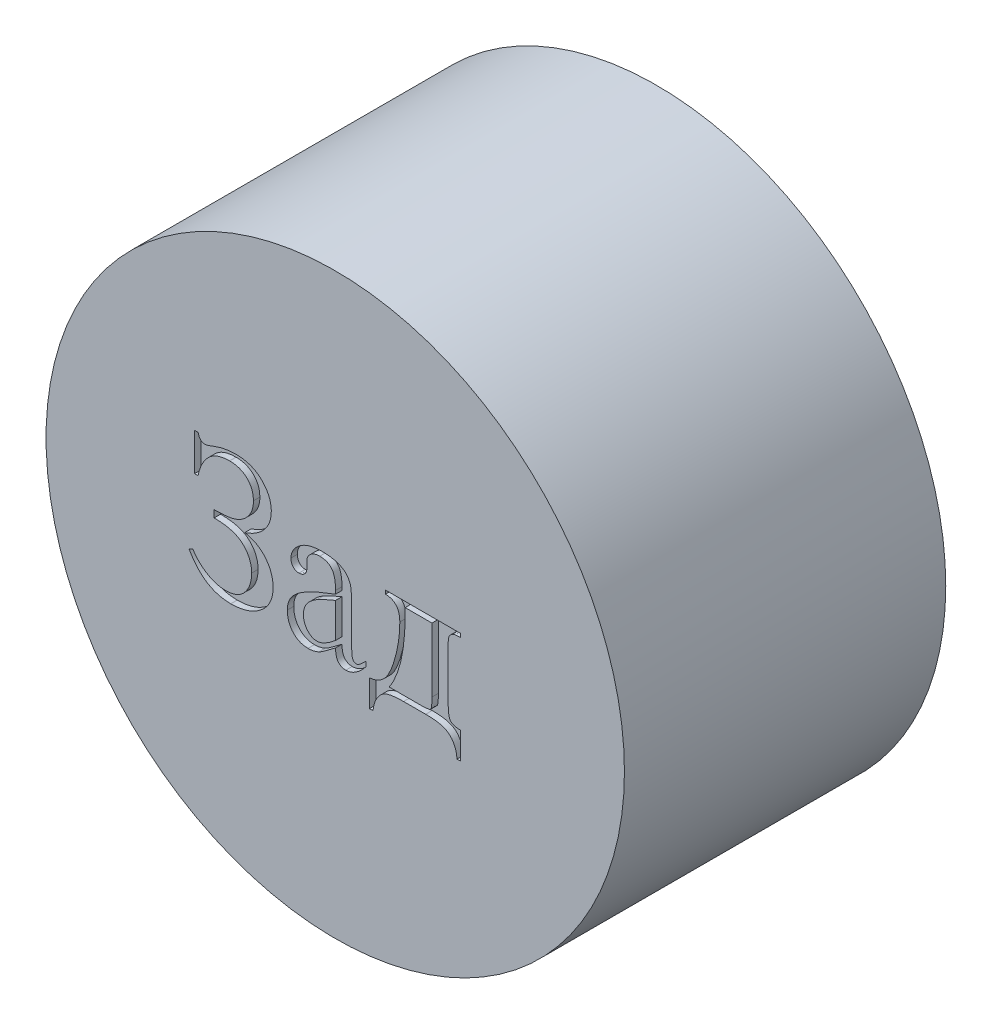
from build123d import *

# Parameters (mm, degrees)
SKETCH_1_R          = 45
EXTRUDE_1_DEPTH     = 50
CUT_EXTRUDE_1_DEPTH = 1
CUT_EXTRUDE_2_DEPTH = 1


with BuildPart() as part:
    # Sketch 1 → Extrude 1 (new body)
    with BuildSketch(Plane.XY):
        Circle(SKETCH_1_R)
    extrude(amount=EXTRUDE_1_DEPTH)

    # Sketch 2 → Cut-Extrude 1 (cut)
    # profile 1 of 3: a face of its own
    with BuildSketch(Plane.XY.offset(50)):
        with BuildLine():
            Line((-21.897257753, 6.710710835), (-21.897257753, 12.544044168))
            Line((-21.897257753, 12.544044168), (-21.341702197, 12.544044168))
            add(Edge.make_bspline(
                [(-21.341702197, 12.544044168), (-21.320378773, 12.461004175), (-21.27965936, 12.302430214), (-21.193013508, 12.084983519), (-21.089241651, 11.8958037), (-20.958088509, 11.745513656), (-20.812283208, 11.622016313), (-20.643784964, 11.539398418), (-20.456120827, 11.49049336), (-20.324940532, 11.484037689), (-20.256632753, 11.480676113)],
                knots=[0, 0, 0, 0, 1.235856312, 2.360002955, 3.36979489, 4.332079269, 5.222142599, 6.109017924, 7.015333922, 8, 8, 8, 8], degree=3))
            add(Edge.make_bspline(
                [(-20.256632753, 11.480676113), (-20.186863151, 11.487561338), (-20.015638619, 11.504458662), (-19.7177076, 11.593353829), (-19.329887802, 11.728724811), (-19.041047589, 11.839957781), (-18.880764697, 11.901683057)],
                knots=[0, 0, 0, 0, 0.581788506, 1.427791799, 2.57263306, 4, 4, 4, 4], degree=3))
            add(Edge.make_bspline(
                [(-18.880764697, 11.901683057), (-18.603318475, 12.001662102), (-18.048941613, 12.201434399), (-17.183361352, 12.394838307), (-16.300744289, 12.523320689), (-15.70414669, 12.537110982), (-15.404202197, 12.544044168)],
                knots=[0, 0, 0, 0, 0.994584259, 1.987320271, 2.988108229, 4, 4, 4, 4], degree=3))
            add(Edge.make_bspline(
                [(-15.404202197, 12.544044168), (-15.204354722, 12.540296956), (-14.812075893, 12.532941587), (-14.239440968, 12.462973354), (-13.697973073, 12.345044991), (-13.185572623, 12.184642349), (-12.703965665, 11.976759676), (-12.251919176, 11.721754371), (-11.828941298, 11.423444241), (-11.446157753, 11.07397497), (-11.09757339, 10.700973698), (-10.791606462, 10.309256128), (-10.532390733, 9.901097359), (-10.318507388, 9.477555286), (-10.158506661, 9.034978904), (-10.041041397, 8.580304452), (-9.962541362, 8.10954519), (-9.956083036, 7.788864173), (-9.952813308, 7.626509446)],
                knots=[0, 0, 0, 0, 1.170527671, 2.297618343, 3.373335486, 4.413498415, 5.438597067, 6.440585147, 7.449611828, 8.464000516, 9.471602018, 10.438074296, 11.371646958, 12.300396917, 13.21216504, 14.122947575, 15.049683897, 16, 16, 16, 16], degree=3))
            add(Edge.make_bspline(
                [(-9.952813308, 7.626509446), (-9.956219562, 7.480263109), (-9.962952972, 7.191166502), (-10.014295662, 6.764861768), (-10.10812196, 6.356535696), (-10.227605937, 5.961053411), (-10.390829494, 5.585287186), (-10.58055181, 5.220846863), (-10.812952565, 4.87790696), (-11.168612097, 4.44218142), (-11.684458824, 3.945787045), (-12.390430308, 3.427378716), (-13.19233738, 2.998274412), (-13.773526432, 2.789867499), (-14.071736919, 2.682933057)],
                knots=[0, 0, 0, 0, 0.761314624, 1.504950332, 2.230398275, 2.940313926, 3.652383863, 4.359938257, 5.076455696, 5.804596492, 7.285331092, 8.788782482, 10.35231112, 12, 12, 12, 12], degree=3))
            add(Edge.make_bspline(
                [(-14.071736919, 2.682933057), (-13.907777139, 2.648897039), (-13.584237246, 2.581734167), (-13.114483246, 2.445704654), (-12.674331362, 2.263057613), (-12.256344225, 2.057978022), (-11.867160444, 1.812644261), (-11.507065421, 1.531715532), (-11.164019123, 1.225554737), (-10.860676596, 0.876879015), (-10.582174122, 0.509389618), (-10.338701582, 0.123542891), (-10.133020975, -0.280431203), (-9.962114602, -0.699120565), (-9.83982018, -1.137239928), (-9.740576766, -1.587108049), (-9.684137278, -2.055201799), (-9.678090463, -2.373348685), (-9.67503553, -2.534080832)],
                knots=[0, 0, 0, 0, 1.079208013, 2.129588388, 3.146058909, 4.14692564, 5.127473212, 6.104823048, 7.088381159, 8.085810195, 9.077994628, 10.0585422, 11.021912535, 11.99681259, 12.96773536, 13.949877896, 14.964250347, 16, 16, 16, 16], degree=3))
            add(Edge.make_bspline(
                [(-9.67503553, -2.534080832), (-9.681010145, -2.731167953), (-9.69275534, -3.118611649), (-9.781410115, -3.686511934), (-9.926549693, -4.226705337), (-10.140672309, -4.735657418), (-10.403797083, -5.220385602), (-10.734220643, -5.674708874), (-11.121899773, -6.100452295), (-11.563717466, -6.493300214), (-12.049299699, -6.846584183), (-12.564409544, -7.161217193), (-13.112830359, -7.421044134), (-13.684871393, -7.640653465), (-14.289236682, -7.802965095), (-14.919583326, -7.927092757), (-15.580692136, -7.994592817), (-16.030512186, -8.005808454), (-16.259236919, -8.011511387)],
                knots=[0, 0, 0, 0, 0.98804211, 1.942342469, 2.875220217, 3.786056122, 4.705004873, 5.635311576, 6.595797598, 7.587562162, 8.594680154, 9.603808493, 10.609802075, 11.633920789, 12.672433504, 13.743903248, 14.85281875, 16, 16, 16, 16], degree=3))
            add(Edge.make_bspline(
                [(-16.259236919, -8.011511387), (-16.431520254, -8.008006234), (-16.770961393, -8.001100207), (-17.272483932, -7.951430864), (-17.758826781, -7.875331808), (-18.230681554, -7.762269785), (-18.685373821, -7.611354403), (-19.131870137, -7.442558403), (-19.555324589, -7.224195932), (-19.970854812, -6.988502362), (-20.367131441, -6.711958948), (-20.748428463, -6.402822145), (-21.118107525, -6.065023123), (-21.469583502, -5.693290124), (-21.811528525, -5.292647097), (-22.132812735, -4.855380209), (-22.444785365, -4.388651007), (-22.634073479, -4.060110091), (-22.730591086, -3.892587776)],
                knots=[0, 0, 0, 0, 1.022395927, 2.014374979, 2.988427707, 3.942287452, 4.889982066, 5.830766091, 6.771589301, 7.714174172, 8.664549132, 9.635455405, 10.626058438, 11.63425701, 12.669944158, 13.750164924, 14.852813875, 16, 16, 16, 16], degree=3))
            Line((-22.730591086, -3.892587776), (-22.17503553, -3.567066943))
            add(Edge.make_bspline(
                [(-22.17503553, -3.567066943), (-22.044213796, -3.771953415), (-21.779691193, -4.186235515), (-21.27991558, -4.746739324), (-20.702953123, -5.265388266), (-20.055041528, -5.733557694), (-19.351214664, -6.130620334), (-18.603400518, -6.412612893), (-17.828681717, -6.591347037), (-17.301866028, -6.612136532), (-17.036146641, -6.622622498)],
                knots=[0, 0, 0, 0, 0.933865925, 1.888284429, 2.877365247, 3.913803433, 4.957611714, 5.975718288, 6.978977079, 8, 8, 8, 8], degree=3))
            add(Edge.make_bspline(
                [(-17.036146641, -6.622622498), (-16.881203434, -6.6178367), (-16.578959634, -6.608501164), (-16.137674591, -6.553781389), (-15.723359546, -6.452870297), (-15.33559824, -6.314778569), (-14.974362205, -6.135828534), (-14.645163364, -5.911523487), (-14.33609501, -5.654552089), (-14.062608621, -5.354624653), (-13.814637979, -5.028866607), (-13.59898172, -4.682677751), (-13.412959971, -4.319247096), (-13.26851299, -3.93665128), (-13.147937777, -3.538650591), (-13.067475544, -3.122696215), (-13.018795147, -2.688599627), (-13.011894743, -2.393876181), (-13.008368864, -2.243282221)],
                knots=[0, 0, 0, 0, 1.111091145, 2.167377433, 3.181253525, 4.162283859, 5.113241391, 6.062613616, 7.012212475, 7.988405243, 8.965534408, 9.944093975, 10.908979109, 11.887538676, 12.87212695, 13.887222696, 14.920440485, 16, 16, 16, 16], degree=3))
            add(Edge.make_bspline(
                [(-13.008368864, -2.243282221), (-13.012923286, -2.088321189), (-13.021897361, -1.782984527), (-13.081518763, -1.332660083), (-13.192096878, -0.903181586), (-13.339203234, -0.49052529), (-13.532917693, -0.099410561), (-13.76293019, 0.278472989), (-14.042715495, 0.632302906), (-14.360739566, 0.969654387), (-14.72514403, 1.281837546), (-15.151458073, 1.547377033), (-15.633658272, 1.765459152), (-16.166684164, 1.955388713), (-16.757800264, 2.09516514), (-17.40384289, 2.19287495), (-18.104133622, 2.254088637), (-18.589834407, 2.262107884), (-18.841702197, 2.266266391)],
                knots=[0, 0, 0, 0, 0.890305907, 1.754267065, 2.602940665, 3.433762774, 4.266412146, 5.106042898, 5.970603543, 6.852489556, 7.766646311, 8.719034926, 9.726790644, 10.801939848, 11.965110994, 13.20998532, 14.553193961, 16, 16, 16, 16], degree=3))
            Line((-18.841702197, 2.266266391), (-18.841702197, 3.377377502))
            add(Edge.make_bspline(
                [(-18.841702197, 3.377377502), (-18.655063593, 3.379766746), (-18.293286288, 3.38439802), (-17.769181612, 3.399345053), (-17.279638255, 3.433365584), (-16.827087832, 3.487371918), (-16.407651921, 3.544781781), (-16.026745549, 3.623058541), (-15.68049198, 3.714653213), (-15.26786425, 3.850009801), (-14.798688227, 4.070175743), (-14.287255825, 4.401675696), (-13.838556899, 4.810861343), (-13.446052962, 5.28067103), (-13.122961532, 5.806224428), (-12.898418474, 6.384492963), (-12.751567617, 6.99852816), (-12.737673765, 7.423097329), (-12.730591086, 7.639530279)],
                knots=[0, 0, 0, 0, 1.058908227, 2.05257088, 2.974164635, 3.841572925, 4.637837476, 5.375061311, 6.045979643, 6.668893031, 7.836596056, 8.974822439, 10.113817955, 11.267679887, 12.438810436, 13.595616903, 14.774315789, 16, 16, 16, 16], degree=3))
            add(Edge.make_bspline(
                [(-12.730591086, 7.639530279), (-12.734621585, 7.765486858), (-12.742520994, 8.012350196), (-12.784020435, 8.374891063), (-12.863857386, 8.71883917), (-12.970890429, 9.047409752), (-13.115756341, 9.354173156), (-13.286606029, 9.646325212), (-13.491622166, 9.918824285), (-13.72447471, 10.174497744), (-13.985034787, 10.404262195), (-14.269341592, 10.60668199), (-14.577937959, 10.773998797), (-14.907134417, 10.915714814), (-15.259659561, 11.02254529), (-15.634080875, 11.10198304), (-16.031178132, 11.143310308), (-16.302558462, 11.151143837), (-16.441528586, 11.155155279)],
                knots=[0, 0, 0, 0, 1.050240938, 2.058375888, 3.03545227, 3.98879961, 4.932950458, 5.857412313, 6.805252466, 7.769746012, 8.735143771, 9.695406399, 10.672259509, 11.65556693, 12.67781137, 13.737357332, 14.841331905, 16, 16, 16, 16], degree=3))
            add(Edge.make_bspline(
                [(-16.441528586, 11.155155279), (-16.613903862, 11.152773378), (-16.95112159, 11.148113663), (-17.441520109, 11.084022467), (-17.903311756, 10.989737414), (-18.338168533, 10.860673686), (-18.742664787, 10.686489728), (-19.117057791, 10.472330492), (-19.46406826, 10.224453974), (-19.77575088, 9.934731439), (-20.062357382, 9.617364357), (-20.323836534, 9.273269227), (-20.556352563, 8.904494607), (-20.767469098, 8.513393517), (-20.954195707, 8.099346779), (-21.10820901, 7.656599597), (-21.246170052, 7.194236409), (-21.309564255, 6.873373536), (-21.341702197, 6.710710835)],
                knots=[0, 0, 0, 0, 1.13550428, 2.221386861, 3.253816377, 4.24034295, 5.205809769, 6.149747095, 7.078777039, 8.01025116, 8.948777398, 9.894832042, 10.855198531, 11.819534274, 12.822699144, 13.845259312, 14.907645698, 16, 16, 16, 16], degree=3))
            Line((-21.341702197, 6.710710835), (-21.897257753, 6.710710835))
        make_face()
    # profile 2 of 3: a face of its own
    with BuildSketch(Plane.XY.offset(50)):
        with BuildLine():
            add(Edge.make_bspline(
                [(0.047186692, -5.802309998), (-0.117344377, -5.928709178), (-0.429420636, -6.168458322), (-0.877944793, -6.500209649), (-1.271846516, -6.799304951), (-1.622604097, -7.048226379), (-1.923740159, -7.259957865), (-2.177582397, -7.426792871), (-2.380797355, -7.557049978), (-2.504493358, -7.62015245), (-2.556979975, -7.646928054)],
                knots=[0, 0, 0, 0, 1.558875, 2.95681467, 4.191698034, 5.274657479, 6.188356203, 6.95716577, 7.557505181, 8, 8, 8, 8], degree=3))
            add(Edge.make_bspline(
                [(-2.556979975, -7.646928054), (-2.690320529, -7.703915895), (-2.956160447, -7.817532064), (-3.375858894, -7.925935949), (-3.805711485, -8.001048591), (-4.097438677, -8.007991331), (-4.24534803, -8.011511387)],
                knots=[0, 0, 0, 0, 0.998482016, 1.990665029, 2.981241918, 4, 4, 4, 4], degree=3))
            add(Edge.make_bspline(
                [(-4.24534803, -8.011511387), (-4.359754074, -8.007537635), (-4.583594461, -7.999762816), (-4.912871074, -7.957449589), (-5.225585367, -7.878912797), (-5.521353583, -7.769123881), (-5.804142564, -7.634649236), (-6.068702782, -7.462860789), (-6.321416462, -7.263604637), (-6.554937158, -7.033104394), (-6.766901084, -6.779366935), (-6.949037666, -6.503006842), (-7.109703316, -6.210216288), (-7.230941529, -5.893439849), (-7.334739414, -5.560831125), (-7.400683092, -5.208266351), (-7.447243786, -4.837121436), (-7.45092561, -4.582850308), (-7.452813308, -4.452483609)],
                knots=[0, 0, 0, 0, 1.021269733, 1.99815853, 2.956354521, 3.891750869, 4.809880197, 5.744652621, 6.700410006, 7.677298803, 8.667491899, 9.645063, 10.627057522, 11.641202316, 12.666381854, 13.732374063, 14.837371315, 16, 16, 16, 16], degree=3))
            add(Edge.make_bspline(
                [(-7.452813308, -4.452483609), (-7.449190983, -4.28844676), (-7.442147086, -3.969464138), (-7.3479071, -3.512040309), (-7.2211904, -3.081848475), (-7.079975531, -2.825732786), (-7.010104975, -2.699011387)],
                knots=[0, 0, 0, 0, 1.073591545, 2.087683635, 3.053820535, 4, 4, 4, 4], degree=3))
            add(Edge.make_bspline(
                [(-7.010104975, -2.699011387), (-6.896498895, -2.527244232), (-6.657887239, -2.166474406), (-6.176858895, -1.68003973), (-5.59396002, -1.204735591), (-5.023962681, -0.830399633), (-4.498846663, -0.523545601), (-4.029610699, -0.284619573), (-3.501301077, -0.027485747), (-2.914636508, 0.246944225), (-2.258907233, 0.5220036), (-1.545908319, 0.81631837), (-0.771909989, 1.127058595), (-0.232489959, 1.328493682), (0.047186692, 1.432933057)],
                knots=[0, 0, 0, 0, 0.890335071, 1.870008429, 2.947759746, 4.145438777, 4.819447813, 5.581919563, 6.425634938, 7.365025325, 8.387143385, 9.505655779, 10.706740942, 12, 12, 12, 12], degree=3))
            Line((0.047186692, 1.432933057), (0.047186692, 1.940745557))
            add(Edge.make_bspline(
                [(0.047186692, 1.940745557), (0.045876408, 2.095583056), (0.043350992, 2.394014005), (0.014302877, 2.82326188), (-0.040467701, 3.21359132), (-0.099740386, 3.568204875), (-0.192996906, 3.880969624), (-0.300094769, 4.158666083), (-0.429594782, 4.398282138), (-0.626498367, 4.66573127), (-0.928627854, 4.934904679), (-1.362900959, 5.165647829), (-1.870434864, 5.301606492), (-2.23203614, 5.31484921), (-2.422431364, 5.321821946)],
                knots=[0, 0, 0, 0, 1.156239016, 2.228513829, 3.209486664, 4.099496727, 4.909803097, 5.642093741, 6.318967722, 6.93697649, 8.115067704, 9.304155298, 10.580547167, 12, 12, 12, 12], degree=3))
            add(Edge.make_bspline(
                [(-2.422431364, 5.321821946), (-2.567824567, 5.317169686), (-2.846187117, 5.308262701), (-3.239010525, 5.207886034), (-3.591011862, 5.056835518), (-3.78249127, 4.899750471), (-3.876424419, 4.822690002)],
                knots=[0, 0, 0, 0, 1.106638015, 2.118713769, 3.077106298, 4, 4, 4, 4], degree=3))
            add(Edge.make_bspline(
                [(-3.876424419, 4.822690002), (-3.961550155, 4.74073267), (-4.124214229, 4.584122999), (-4.296477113, 4.300313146), (-4.408268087, 4.000453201), (-4.421172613, 3.790669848), (-4.427639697, 3.685537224)],
                knots=[0, 0, 0, 0, 1.084622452, 2.072570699, 3.034071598, 4, 4, 4, 4], degree=3))
            Line((-4.427639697, 3.685537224), (-4.397257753, 2.834842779))
            add(Edge.make_bspline(
                [(-4.397257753, 2.834842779), (-4.400830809, 2.728808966), (-4.407613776, 2.527518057), (-4.474442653, 2.243908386), (-4.580443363, 1.99597837), (-4.737567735, 1.793098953), (-4.924149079, 1.629938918), (-5.144393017, 1.515045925), (-5.391032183, 1.443045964), (-5.565721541, 1.436377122), (-5.655938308, 1.432933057)],
                knots=[0, 0, 0, 0, 1.192988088, 2.264727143, 3.264608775, 4.207008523, 5.131898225, 6.036298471, 6.985863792, 8, 8, 8, 8], degree=3))
            add(Edge.make_bspline(
                [(-5.655938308, 1.432933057), (-5.74349045, 1.43576287), (-5.913366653, 1.441253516), (-6.15147037, 1.522708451), (-6.371930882, 1.633473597), (-6.557010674, 1.802409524), (-6.713046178, 2.00824956), (-6.819448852, 2.255585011), (-6.886683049, 2.534704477), (-6.893623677, 2.73169803), (-6.897257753, 2.834842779)],
                knots=[0, 0, 0, 0, 0.992015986, 1.924794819, 2.838757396, 3.784255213, 4.749783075, 5.760236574, 6.827272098, 8, 8, 8, 8], degree=3))
            add(Edge.make_bspline(
                [(-6.897257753, 2.834842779), (-6.892900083, 2.937887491), (-6.884231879, 3.142862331), (-6.819717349, 3.445952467), (-6.721318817, 3.743384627), (-6.573968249, 4.031525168), (-6.390154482, 4.314565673), (-6.168336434, 4.594200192), (-5.901084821, 4.861799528), (-5.598249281, 5.122699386), (-5.257745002, 5.364039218), (-4.883418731, 5.577898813), (-4.47423805, 5.756716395), (-4.033910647, 5.902783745), (-3.558862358, 6.015643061), (-3.052712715, 6.097520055), (-2.5130194, 6.144597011), (-2.143297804, 6.151576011), (-1.953681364, 6.155155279)],
                knots=[0, 0, 0, 0, 0.751350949, 1.494574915, 2.252349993, 3.031299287, 3.848234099, 4.712108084, 5.630260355, 6.603499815, 7.625714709, 8.670571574, 9.743474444, 10.878456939, 12.051105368, 13.302367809, 14.616484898, 16, 16, 16, 16], degree=3))
            add(Edge.make_bspline(
                [(-1.953681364, 6.155155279), (-1.666776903, 6.14800094), (-1.116615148, 6.134281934), (-0.333322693, 6.021603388), (0.374250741, 5.838178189), (0.794690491, 5.639238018), (0.997707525, 5.543176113)],
                knots=[0, 0, 0, 0, 1.131049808, 2.168876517, 3.115808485, 4, 4, 4, 4], degree=3))
            add(Edge.make_bspline(
                [(0.997707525, 5.543176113), (1.137243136, 5.459825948), (1.415086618, 5.293858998), (1.771060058, 4.955186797), (2.065946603, 4.550770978), (2.209211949, 4.245298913), (2.282429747, 4.089183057)],
                knots=[0, 0, 0, 0, 0.983173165, 1.957695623, 2.956251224, 4, 4, 4, 4], degree=3))
            add(Edge.make_bspline(
                [(2.282429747, 4.089183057), (2.303453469, 4.028671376), (2.349470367, 3.896222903), (2.407092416, 3.671962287), (2.444907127, 3.403864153), (2.487466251, 3.096256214), (2.509245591, 2.745261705), (2.532544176, 2.353335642), (2.544853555, 1.917670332), (2.546384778, 1.613782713), (2.547186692, 1.454634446)],
                knots=[0, 0, 0, 0, 0.578071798, 1.265288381, 2.085304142, 3.019791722, 4.067310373, 5.257317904, 6.563636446, 8, 8, 8, 8], degree=3))
            Line((2.547186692, 1.454634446), (2.547186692, -3.202483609))
            add(Edge.make_bspline(
                [(2.547186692, -3.202483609), (2.546681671, -3.358737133), (2.545727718, -3.653890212), (2.552056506, -4.07342219), (2.55386325, -4.443873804), (2.564749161, -4.767863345), (2.57072744, -5.044384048), (2.585524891, -5.27428422), (2.596012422, -5.456957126), (2.617751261, -5.630037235), (2.655521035, -5.796947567), (2.704435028, -5.964716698), (2.769471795, -6.096658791), (2.863981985, -6.225232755), (3.024122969, -6.319071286), (3.161000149, -6.336323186), (3.228610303, -6.344844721)],
                knots=[0, 0, 0, 0, 1.895498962, 3.580478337, 5.089959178, 6.389201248, 7.513008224, 8.444695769, 9.183712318, 9.732301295, 10.558500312, 11.257899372, 11.846575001, 12.334540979, 13.177350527, 14, 14, 14, 14], degree=3))
            add(Edge.make_bspline(
                [(3.228610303, -6.344844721), (3.300587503, -6.340546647), (3.43809511, -6.332335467), (3.563711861, -6.276139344), (3.623575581, -6.249358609)],
                knots=[0, 0, 0, 0, 1.04688317, 2, 2, 2, 2], degree=3))
            add(Edge.make_bspline(
                [(3.623575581, -6.249358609), (3.685207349, -6.207065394), (3.838278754, -6.102024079), (4.081982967, -5.878662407), (4.408556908, -5.589594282), (4.640416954, -5.360941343), (4.769408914, -5.233733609)],
                knots=[0, 0, 0, 0, 0.584543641, 1.451798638, 2.582345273, 4, 4, 4, 4], degree=3))
            Line((4.769408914, -5.233733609), (4.769408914, -6.010643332))
            add(Edge.make_bspline(
                [(4.769408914, -6.010643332), (4.635407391, -6.168665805), (4.377650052, -6.472628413), (3.974524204, -6.882090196), (3.573584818, -7.227250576), (3.179419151, -7.513310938), (2.786673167, -7.731923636), (2.40015832, -7.892004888), (2.01570763, -7.994096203), (1.757839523, -8.005781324), (1.631388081, -8.011511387)],
                knots=[0, 0, 0, 0, 1.29495671, 2.490901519, 3.587659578, 4.59909354, 5.530268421, 6.390197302, 7.210596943, 8, 8, 8, 8], degree=3))
            add(Edge.make_bspline(
                [(1.631388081, -8.011511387), (1.516294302, -8.006723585), (1.294717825, -7.997506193), (0.982168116, -7.89671352), (0.707145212, -7.738248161), (0.46728921, -7.513220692), (0.276122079, -7.205344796), (0.149727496, -6.811147), (0.060804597, -6.335707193), (0.051964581, -5.989454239), (0.047186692, -5.802309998)],
                knots=[0, 0, 0, 0, 0.892412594, 1.718056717, 2.524775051, 3.344648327, 4.249949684, 5.310413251, 6.546320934, 8, 8, 8, 8], degree=3))
        make_face()
        with BuildLine():
            Line((0.047186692, -4.799705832), (0.047186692, 0.599599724))
            add(Edge.make_bspline(
                [(0.047186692, 0.599599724), (-0.129257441, 0.52423006), (-0.464850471, 0.380878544), (-0.945519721, 0.178101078), (-1.37410805, -0.013991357), (-1.755418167, -0.185876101), (-2.086421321, -0.342898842), (-2.368684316, -0.481551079), (-2.603805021, -0.601892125), (-2.742379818, -0.680387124), (-2.804375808, -0.715504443)],
                knots=[0, 0, 0, 0, 1.465697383, 2.787725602, 3.985057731, 5.053380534, 5.982790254, 6.783498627, 7.455758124, 8, 8, 8, 8], degree=3))
            add(Edge.make_bspline(
                [(-2.804375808, -0.715504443), (-2.986232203, -0.826169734), (-3.331137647, -1.03605546), (-3.785978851, -1.391843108), (-4.164977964, -1.750005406), (-4.460302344, -2.123589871), (-4.685371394, -2.508943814), (-4.8339293, -2.912293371), (-4.937843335, -3.330370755), (-4.947777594, -3.617057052), (-4.952813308, -3.762379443)],
                knots=[0, 0, 0, 0, 1.302370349, 2.470051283, 3.52876103, 4.487475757, 5.376328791, 6.248248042, 7.112030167, 8, 8, 8, 8], degree=3))
            add(Edge.make_bspline(
                [(-4.952813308, -3.762379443), (-4.946021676, -3.941046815), (-4.932939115, -4.285209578), (-4.811694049, -4.779748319), (-4.611765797, -5.225761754), (-4.338062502, -5.615098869), (-4.016751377, -5.935757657), (-3.661066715, -6.173099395), (-3.276125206, -6.315613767), (-3.010934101, -6.335092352), (-2.87816053, -6.344844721)],
                knots=[0, 0, 0, 0, 1.168223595, 2.250321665, 3.310218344, 4.350849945, 5.348877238, 6.265796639, 7.13173418, 8, 8, 8, 8], degree=3))
            add(Edge.make_bspline(
                [(-2.87816053, -6.344844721), (-2.780895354, -6.338777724), (-2.578394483, -6.326146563), (-2.264273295, -6.252257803), (-1.93103062, -6.127899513), (-1.575082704, -5.958070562), (-1.20045432, -5.736325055), (-0.800273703, -5.472180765), (-0.381785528, -5.153653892), (-0.099562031, -4.920789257), (0.047186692, -4.799705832)],
                knots=[0, 0, 0, 0, 0.693887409, 1.444636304, 2.289794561, 3.226439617, 4.252586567, 5.391242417, 6.643515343, 8, 8, 8, 8], degree=3))
        make_face(mode=Mode.SUBTRACT)
    # profile 3 of 3: a face of its own
    with BuildSketch(Plane.XY.offset(50)):
        with BuildLine():
            Line((7.82496447, 5.877377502), (19.491631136, 5.877377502))
            Line((19.491631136, 5.877377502), (19.491631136, 5.321821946))
            add(Edge.make_bspline(
                [(19.491631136, 5.321821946), (19.3469259, 5.319160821), (19.083052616, 5.314308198), (18.724498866, 5.284920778), (18.443492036, 5.223063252), (18.175698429, 5.112079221), (17.9437815, 4.903212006), (17.762218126, 4.698565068), (17.677930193, 4.518242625), (17.648612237, 4.37902679), (17.609575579, 4.202298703), (17.595119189, 3.979094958), (17.569233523, 3.716406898), (17.559540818, 3.410678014), (17.550106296, 3.064941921), (17.548193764, 2.820387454), (17.547186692, 2.691613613)],
                knots=[0, 0, 0, 0, 1.537937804, 2.804464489, 3.814962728, 4.586041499, 5.853687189, 7.090095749, 7.461588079, 7.953746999, 8.595903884, 9.383658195, 10.324523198, 11.401583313, 12.631764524, 14, 14, 14, 14], degree=3))
            Line((17.547186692, 2.691613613), (17.547186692, -4.040157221))
            add(Edge.make_bspline(
                [(17.547186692, -4.040157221), (17.547407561, -4.209455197), (17.547824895, -4.52934603), (17.567083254, -4.983668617), (17.589942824, -5.386442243), (17.6299726, -5.739567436), (17.675391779, -6.041292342), (17.730587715, -6.293118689), (17.796711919, -6.494569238), (17.881375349, -6.651595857), (17.989686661, -6.772838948), (18.122132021, -6.871693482), (18.281217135, -6.959276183), (18.467783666, -7.032693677), (18.684341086, -7.086233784), (18.927038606, -7.13622264), (19.200303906, -7.163950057), (19.391763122, -7.173300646), (19.491631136, -7.178178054)],
                knots=[0, 0, 0, 0, 1.848130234, 3.492067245, 4.964094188, 6.251395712, 7.370642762, 8.294100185, 9.063386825, 9.678597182, 10.226904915, 10.824004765, 11.474499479, 12.204855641, 13.005606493, 13.907052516, 14.908287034, 16, 16, 16, 16], degree=3))
            Line((19.491631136, -7.178178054), (19.491631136, -11.344844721))
            Line((19.491631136, -11.344844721), (18.936075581, -11.344844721))
            add(Edge.make_bspline(
                [(18.936075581, -11.344844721), (18.92187367, -11.156171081), (18.894089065, -10.787050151), (18.775773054, -10.255708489), (18.596382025, -9.762276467), (18.357326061, -9.31172095), (18.069326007, -8.904881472), (17.72102761, -8.559390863), (17.316626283, -8.284820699), (16.852054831, -8.069815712), (16.305897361, -7.915354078), (15.660132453, -7.805976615), (14.902248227, -7.744425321), (14.360090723, -7.737455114), (14.070624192, -7.733733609)],
                knots=[0, 0, 0, 0, 0.982645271, 1.922446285, 2.819500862, 3.704364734, 4.566464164, 5.401463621, 6.240113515, 7.094798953, 8.051512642, 9.181711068, 10.495270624, 12, 12, 12, 12], degree=3))
            Line((14.070624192, -7.733733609), (10.628783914, -7.733733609))
            add(Edge.make_bspline(
                [(10.628783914, -7.733733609), (10.37695958, -7.736733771), (9.900197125, -7.742413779), (9.228743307, -7.792718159), (8.643722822, -7.877684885), (8.133744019, -7.995223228), (7.683737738, -8.176094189), (7.283034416, -8.434465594), (6.917634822, -8.764270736), (6.600369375, -9.170428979), (6.324298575, -9.635537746), (6.114360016, -10.160256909), (5.960225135, -10.734651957), (5.907656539, -11.137097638), (5.880520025, -11.344844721)],
                knots=[0, 0, 0, 0, 1.336114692, 2.529578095, 3.569662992, 4.470828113, 5.300525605, 6.128943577, 6.987715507, 7.900091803, 8.853313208, 9.84836877, 10.889303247, 12, 12, 12, 12], degree=3))
            Line((5.880520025, -11.344844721), (5.32496447, -11.344844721))
            Line((5.32496447, -11.344844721), (5.32496447, -7.178178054))
            add(Edge.make_bspline(
                [(5.32496447, -7.178178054), (5.5245787, -7.159864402), (5.923372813, -7.123276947), (6.500967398, -6.928006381), (7.045371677, -6.624582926), (7.476333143, -6.292273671), (7.794076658, -5.948571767), (8.033723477, -5.634164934), (8.263003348, -5.26274463), (8.481556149, -4.835576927), (8.700023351, -4.357214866), (8.90675537, -3.821917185), (9.106100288, -3.230944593), (9.356037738, -2.373345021), (9.63706326, -1.272674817), (9.86737298, 0.059677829), (10.019662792, 1.378758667), (10.038048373, 2.255727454), (10.047186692, 2.691613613)],
                knots=[0, 0, 0, 0, 0.80746312, 1.613169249, 2.439588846, 3.317560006, 3.79716826, 4.326625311, 4.911984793, 5.557571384, 6.263664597, 7.035228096, 7.874196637, 8.78207414, 10.642986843, 12.458779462, 14.239881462, 16, 16, 16, 16], degree=3))
            add(Edge.make_bspline(
                [(10.047186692, 2.691613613), (10.041258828, 2.891742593), (10.030040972, 3.270465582), (9.928058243, 3.800552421), (9.754270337, 4.255493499), (9.508688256, 4.634972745), (9.186827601, 4.934999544), (8.792985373, 5.150208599), (8.331156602, 5.286448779), (7.999568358, 5.309620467), (7.82496447, 5.321821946)],
                knots=[0, 0, 0, 0, 1.227037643, 2.322039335, 3.294592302, 4.198140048, 5.071173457, 5.965253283, 6.928566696, 8, 8, 8, 8], degree=3))
            Line((7.82496447, 5.321821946), (7.82496447, 5.877377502))
        make_face()
        with BuildLine():
            Line((10.880520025, 5.044044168), (10.880520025, 4.206370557))
            add(Edge.make_bspline(
                [(10.880520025, 4.206370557), (10.879332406, 3.901071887), (10.876990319, 3.298996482), (10.844143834, 2.410562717), (10.799081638, 1.55069399), (10.727795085, 0.721686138), (10.643500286, -0.077692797), (10.53320889, -0.845817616), (10.409919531, -1.584781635), (10.259850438, -2.293285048), (10.098764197, -2.973637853), (9.908865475, -3.622440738), (9.707919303, -4.243749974), (9.480517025, -4.833522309), (9.239592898, -5.395848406), (8.971601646, -5.925210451), (8.69468249, -6.430748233), (8.484095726, -6.745561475), (8.380520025, -6.900400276)],
                knots=[0, 0, 0, 0, 1.269062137, 2.502700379, 3.695356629, 4.848100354, 5.961238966, 7.036325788, 8.073516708, 9.074937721, 10.046438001, 10.979130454, 11.884428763, 12.760115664, 13.605902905, 14.42624644, 15.225959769, 16, 16, 16, 16], degree=3))
            Line((8.380520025, -6.900400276), (13.306735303, -6.900400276))
            add(Edge.make_bspline(
                [(13.306735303, -6.900400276), (13.412335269, -6.899020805), (13.611998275, -6.896412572), (13.893187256, -6.891726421), (14.138967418, -6.867384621), (14.349099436, -6.842970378), (14.524995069, -6.813880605), (14.664691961, -6.777581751), (14.769265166, -6.72935633), (14.848551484, -6.669719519), (14.899235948, -6.577437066), (14.93970247, -6.45720257), (14.974249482, -6.2969573), (14.997093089, -6.099250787), (15.019171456, -5.861935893), (15.036803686, -5.585531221), (15.043708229, -5.268488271), (15.045983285, -5.044208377), (15.047186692, -4.925573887)],
                knots=[0, 0, 0, 0, 1.514918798, 2.864330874, 4.030973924, 5.055336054, 5.897964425, 6.587738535, 7.116771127, 7.544550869, 7.982280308, 8.599233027, 9.364468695, 10.327070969, 11.452383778, 12.782998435, 14.29834351, 16, 16, 16, 16], degree=3))
            Line((15.047186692, -4.925573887), (15.047186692, 5.044044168))
            Line((15.047186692, 5.044044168), (10.880520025, 5.044044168))
        make_face(mode=Mode.SUBTRACT)
    extrude(amount=-CUT_EXTRUDE_1_DEPTH, mode=Mode.SUBTRACT)

    # Sketch 3 → Cut-Extrude 2 (cut)
    # profile 1 of 5: a face of its own
    with BuildSketch(Plane(origin=(0, 0, 0), x_dir=(-1, 0, 0), z_dir=(0, 0, -1))):
        with BuildLine():
            Line((-23.536540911, 9.965001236), (-33.258763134, 9.965001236))
            Line((-33.258763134, 9.965001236), (-33.258763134, -5.59055432))
            add(Edge.make_bspline(
                [(-33.258763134, -5.59055432), (-33.256788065, -5.745371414), (-33.25302045, -6.040698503), (-33.233316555, -6.462338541), (-33.193730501, -6.838743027), (-33.144491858, -7.171538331), (-33.074590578, -7.458574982), (-32.994786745, -7.704650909), (-32.896532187, -7.905873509), (-32.777795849, -8.069830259), (-32.627153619, -8.199830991), (-32.439392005, -8.308086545), (-32.212186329, -8.403598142), (-31.943066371, -8.477715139), (-31.63592383, -8.543427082), (-31.288141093, -8.595224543), (-30.898152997, -8.627986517), (-30.624267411, -8.639885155), (-30.480985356, -8.646109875)],
                knots=[0, 0, 0, 0, 1.493595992, 2.849164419, 4.069851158, 5.143678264, 6.091481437, 6.916799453, 7.63457118, 8.243076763, 8.856206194, 9.538358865, 10.326370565, 11.22739665, 12.226523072, 13.355526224, 14.616555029, 16, 16, 16, 16], degree=3))
            Line((-30.480985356, -8.646109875), (-30.480985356, -9.201665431))
            Line((-30.480985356, -9.201665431), (-38.814318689, -9.201665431))
            Line((-38.814318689, -9.201665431), (-38.814318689, -8.646109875))
            add(Edge.make_bspline(
                [(-38.814318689, -8.646109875), (-38.67248712, -8.639863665), (-38.401498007, -8.627929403), (-38.015781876, -8.595483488), (-37.669706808, -8.542300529), (-37.363591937, -8.478871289), (-37.095744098, -8.404052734), (-36.871736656, -8.305639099), (-36.681431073, -8.201528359), (-36.531050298, -8.068288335), (-36.406394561, -7.907673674), (-36.31065692, -7.703481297), (-36.223093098, -7.45976207), (-36.157012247, -7.170870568), (-36.099617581, -6.839342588), (-36.06261021, -6.462223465), (-36.04210183, -6.040732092), (-36.038453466, -5.745382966), (-36.036540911, -5.59055432)],
                knots=[0, 0, 0, 0, 1.371813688, 2.621042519, 3.738124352, 4.752607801, 5.641734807, 6.418218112, 7.113569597, 7.727731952, 8.345701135, 9.064682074, 9.895987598, 10.845387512, 11.923292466, 13.146035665, 14.503887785, 16, 16, 16, 16], degree=3))
            Line((-36.036540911, -5.59055432), (-36.036540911, 7.187223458))
            add(Edge.make_bspline(
                [(-36.036540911, 7.187223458), (-36.038453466, 7.342052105), (-36.04210183, 7.637401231), (-36.06261021, 8.058892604), (-36.099617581, 8.436011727), (-36.157012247, 8.767539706), (-36.223093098, 9.056431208), (-36.31065692, 9.300150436), (-36.406394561, 9.504342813), (-36.531050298, 9.664957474), (-36.681431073, 9.798197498), (-36.871736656, 9.902308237), (-37.095744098, 10.000721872), (-37.363591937, 10.075540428), (-37.669706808, 10.138969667), (-38.015781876, 10.192152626), (-38.401498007, 10.224598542), (-38.67248712, 10.236532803), (-38.814318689, 10.242779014)],
                knots=[0, 0, 0, 0, 1.496112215, 2.853964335, 4.076707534, 5.154612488, 6.104012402, 6.935317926, 7.654298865, 8.272268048, 8.886430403, 9.581781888, 10.358265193, 11.247392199, 12.261875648, 13.378957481, 14.628186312, 16, 16, 16, 16], degree=3))
            Line((-38.814318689, 10.242779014), (-38.814318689, 10.798334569))
            Line((-38.814318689, 10.798334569), (-17.980985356, 10.798334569))
            Line((-17.980985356, 10.798334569), (-17.980985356, 10.242779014))
            add(Edge.make_bspline(
                [(-17.980985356, 10.242779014), (-18.122822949, 10.236572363), (-18.393823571, 10.224713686), (-18.780888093, 10.191635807), (-19.127216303, 10.139979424), (-19.433116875, 10.075096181), (-19.700550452, 9.999705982), (-19.926936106, 9.903400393), (-20.11815076, 9.798091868), (-20.268668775, 9.665004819), (-20.392988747, 9.504245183), (-20.48999652, 9.301007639), (-20.570669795, 9.055391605), (-20.638826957, 8.767726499), (-20.695513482, 8.435951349), (-20.732748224, 8.058911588), (-20.753186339, 7.637395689), (-20.756845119, 7.342050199), (-20.758763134, 7.187223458)],
                knots=[0, 0, 0, 0, 1.371093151, 2.619665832, 3.749976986, 4.750260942, 5.638920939, 6.427845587, 7.122831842, 7.736671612, 8.354316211, 9.072919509, 9.899193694, 10.848094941, 11.925433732, 13.147534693, 14.504673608, 16, 16, 16, 16], degree=3))
            Line((-20.758763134, 7.187223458), (-20.758763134, -5.59055432))
            add(Edge.make_bspline(
                [(-20.758763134, -5.59055432), (-20.756845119, -5.74538106), (-20.753186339, -6.040726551), (-20.732748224, -6.462242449), (-20.695513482, -6.83928221), (-20.638826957, -7.17105736), (-20.570669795, -7.458722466), (-20.48999652, -7.704338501), (-20.392988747, -7.907576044), (-20.268668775, -8.068335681), (-20.11815076, -8.20142273), (-19.926936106, -8.306731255), (-19.700550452, -8.403036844), (-19.433116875, -8.478427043), (-19.127216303, -8.543310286), (-18.780888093, -8.594966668), (-18.393823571, -8.628044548), (-18.122822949, -8.639903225), (-17.980985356, -8.646109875)],
                knots=[0, 0, 0, 0, 1.495326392, 2.852465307, 4.074566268, 5.151905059, 6.100806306, 6.927080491, 7.645683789, 8.263328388, 8.877168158, 9.572154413, 10.361079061, 11.249739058, 12.250023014, 13.380334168, 14.628906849, 16, 16, 16, 16], degree=3))
            Line((-17.980985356, -8.646109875), (-17.980985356, -9.201665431))
            Line((-17.980985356, -9.201665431), (-26.314318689, -9.201665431))
            Line((-26.314318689, -9.201665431), (-26.314318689, -8.646109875))
            add(Edge.make_bspline(
                [(-26.314318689, -8.646109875), (-26.172487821, -8.639868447), (-25.901500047, -8.627943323), (-25.515774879, -8.595435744), (-25.171128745, -8.542667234), (-24.866287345, -8.478995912), (-24.600359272, -8.40152804), (-24.371448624, -8.312315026), (-24.183304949, -8.204966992), (-24.029496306, -8.077308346), (-23.907920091, -7.916826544), (-23.809370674, -7.715790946), (-23.722655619, -7.471345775), (-23.657601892, -7.180885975), (-23.599515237, -6.848039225), (-23.56245644, -6.469462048), (-23.542136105, -6.045068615), (-23.538464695, -5.746829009), (-23.536540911, -5.59055432)],
                knots=[0, 0, 0, 0, 1.370635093, 2.618790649, 3.734912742, 4.734862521, 5.623225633, 6.406549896, 7.101303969, 7.70580931, 8.323247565, 9.029145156, 9.859736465, 10.821901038, 11.89887991, 13.120572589, 14.491207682, 16, 16, 16, 16], degree=3))
            Line((-23.536540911, -5.59055432), (-23.536540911, 9.965001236))
        make_face()
    # profile 2 of 5: a face of its own
    with BuildSketch(Plane(origin=(0, 0, 0), x_dir=(-1, 0, 0), z_dir=(0, 0, -1))):
        with BuildLine():
            add(Edge.make_bspline(
                [(-14.092096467, -0.59055432), (-14.090450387, -0.833808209), (-14.087248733, -1.306941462), (-14.013820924, -1.995723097), (-13.903048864, -2.642992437), (-13.748097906, -3.252979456), (-13.539342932, -3.820607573), (-13.286385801, -4.350193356), (-12.989318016, -4.841179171), (-12.748799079, -5.133144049), (-12.629422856, -5.27805432)],
                knots=[0, 0, 0, 0, 1.162384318, 2.260858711, 3.30706405, 4.300249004, 5.265287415, 6.193428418, 7.10334839, 8, 8, 8, 8], degree=3))
            add(Edge.make_bspline(
                [(-12.629422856, -5.27805432), (-12.506141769, -5.41373959), (-12.26626599, -5.677750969), (-11.869327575, -6.023697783), (-11.459531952, -6.320144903), (-11.03049767, -6.55947247), (-10.588394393, -6.751908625), (-10.125897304, -6.877244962), (-9.649630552, -6.966637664), (-9.325452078, -6.975142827), (-9.161540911, -6.979443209)],
                knots=[0, 0, 0, 0, 1.101868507, 2.143974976, 3.160628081, 4.138556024, 5.093803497, 6.052453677, 7.015281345, 8, 8, 8, 8], degree=3))
            add(Edge.make_bspline(
                [(-9.161540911, -6.979443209), (-8.946804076, -6.97253345), (-8.528419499, -6.959070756), (-7.924322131, -6.837098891), (-7.360307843, -6.648434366), (-6.927602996, -6.415970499), (-6.60088849, -6.188042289), (-6.371884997, -5.970990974), (-6.14858557, -5.722213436), (-5.937195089, -5.435522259), (-5.736917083, -5.111129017), (-5.546771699, -4.749575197), (-5.364086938, -4.351652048), (-5.257887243, -4.069276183), (-5.203207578, -3.923887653)],
                knots=[0, 0, 0, 0, 1.426581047, 2.779492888, 4.081747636, 5.36873652, 6.030860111, 6.725327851, 7.46121488, 8.252094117, 9.090416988, 9.994254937, 10.967290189, 12, 12, 12, 12], degree=3))
            Line((-5.203207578, -3.923887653), (-4.9254298, -4.201665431))
            add(Edge.make_bspline(
                [(-4.9254298, -4.201665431), (-4.954694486, -4.377238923), (-5.01270064, -4.725246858), (-5.144192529, -5.234855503), (-5.31222606, -5.726223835), (-5.524134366, -6.197476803), (-5.766818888, -6.653327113), (-6.043537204, -7.094011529), (-6.365236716, -7.510730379), (-6.711373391, -7.912277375), (-7.089376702, -8.282101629), (-7.50212675, -8.597890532), (-7.929447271, -8.876243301), (-8.388461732, -9.092007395), (-8.865203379, -9.268530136), (-9.369503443, -9.388374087), (-9.895635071, -9.4642062), (-10.255025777, -9.474310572), (-10.437582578, -9.479443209)],
                knots=[0, 0, 0, 0, 1.023883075, 2.029460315, 3.024679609, 4.008622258, 4.999339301, 5.994802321, 6.998862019, 8.025618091, 9.04420729, 10.035064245, 11.012008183, 11.97271211, 12.94716973, 13.932555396, 14.949816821, 16, 16, 16, 16], degree=3))
            add(Edge.make_bspline(
                [(-10.437582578, -9.479443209), (-10.636090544, -9.47336957), (-11.02779258, -9.46138488), (-11.604505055, -9.373230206), (-12.158425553, -9.224547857), (-12.690898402, -9.019369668), (-13.202533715, -8.757607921), (-13.691148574, -8.433858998), (-14.155382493, -8.048735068), (-14.59772633, -7.613280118), (-14.999470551, -7.124690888), (-15.35202801, -6.592100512), (-15.655070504, -6.022585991), (-15.891212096, -5.407241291), (-16.084667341, -4.756353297), (-16.215586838, -4.0626056), (-16.301777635, -3.33000395), (-16.310066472, -2.82750538), (-16.314318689, -2.569720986)],
                knots=[0, 0, 0, 0, 0.93899323, 1.852850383, 2.752783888, 3.64770525, 4.547742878, 5.466610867, 6.414913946, 7.397480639, 8.399244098, 9.40163878, 10.415120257, 11.444723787, 12.514741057, 13.623594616, 14.780891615, 16, 16, 16, 16], degree=3))
            add(Edge.make_bspline(
                [(-16.314318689, -2.569720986), (-16.310616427, -2.291638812), (-16.303404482, -1.749939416), (-16.210018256, -0.963148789), (-16.08247376, -0.220671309), (-15.883679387, 0.471008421), (-15.638485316, 1.120474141), (-15.328382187, 1.717451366), (-14.971106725, 2.27384919), (-14.553069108, 2.772171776), (-14.101213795, 3.224977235), (-13.61035029, 3.612060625), (-13.095350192, 3.945289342), (-12.552404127, 4.220578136), (-11.978002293, 4.430343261), (-11.37641386, 4.575381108), (-10.747337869, 4.671057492), (-10.317860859, 4.681766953), (-10.099040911, 4.687223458)],
                knots=[0, 0, 0, 0, 1.241092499, 2.417627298, 3.53408723, 4.601715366, 5.626389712, 6.629074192, 7.60035585, 8.573183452, 9.528016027, 10.45228174, 11.359107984, 12.263491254, 13.164892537, 14.083154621, 15.023360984, 16, 16, 16, 16], degree=3))
            add(Edge.make_bspline(
                [(-10.099040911, 4.687223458), (-9.913602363, 4.68373041), (-9.551475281, 4.676909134), (-9.021532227, 4.603712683), (-8.517059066, 4.492557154), (-8.037197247, 4.335715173), (-7.581375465, 4.134900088), (-7.151958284, 3.887770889), (-6.748196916, 3.592987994), (-6.374110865, 3.25613624), (-6.030668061, 2.885229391), (-5.731991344, 2.478351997), (-5.486302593, 2.037630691), (-5.280520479, 1.56997358), (-5.118616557, 1.073061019), (-5.008460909, 0.544671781), (-4.935832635, -0.012722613), (-4.928950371, -0.395002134), (-4.9254298, -0.59055432)],
                knots=[0, 0, 0, 0, 1.069756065, 2.089035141, 3.081797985, 4.04836344, 4.998041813, 5.95204309, 6.902492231, 7.878285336, 8.853506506, 9.815624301, 10.784135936, 11.760107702, 12.761021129, 13.794568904, 14.871828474, 16, 16, 16, 16], degree=3))
            Line((-4.9254298, -0.59055432), (-14.092096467, -0.59055432))
        make_face()
        with BuildLine():
            Line((-14.092096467, 0.242779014), (-7.980985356, 0.242779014))
            add(Edge.make_bspline(
                [(-7.980985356, 0.242779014), (-7.994966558, 0.444068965), (-8.020775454, 0.8156444), (-8.083361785, 1.323283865), (-8.164411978, 1.737564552), (-8.247768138, 1.973767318), (-8.2848048, 2.078716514)],
                knots=[0, 0, 0, 0, 1.29604011, 2.392452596, 3.285737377, 4, 4, 4, 4], degree=3))
            add(Edge.make_bspline(
                [(-8.2848048, 2.078716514), (-8.349812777, 2.210499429), (-8.47786959, 2.470093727), (-8.719613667, 2.828218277), (-9.022730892, 3.12707952), (-9.353418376, 3.387544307), (-9.711595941, 3.595175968), (-10.0827775, 3.744308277), (-10.463568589, 3.835786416), (-10.72065594, 3.847833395), (-10.849908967, 3.853890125)],
                knots=[0, 0, 0, 0, 1.069478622, 2.106726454, 3.127151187, 4.15537463, 5.165307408, 6.129606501, 7.059642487, 8, 8, 8, 8], degree=3))
            add(Edge.make_bspline(
                [(-10.849908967, 3.853890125), (-11.045094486, 3.842018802), (-11.433618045, 3.818388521), (-11.997689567, 3.631875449), (-12.52148573, 3.32054958), (-12.926324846, 2.98070958), (-13.215344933, 2.649337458), (-13.416429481, 2.376114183), (-13.590732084, 2.07722205), (-13.742438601, 1.756589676), (-13.869461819, 1.411003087), (-13.966465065, 1.041283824), (-14.047225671, 0.650390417), (-14.076929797, 0.380554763), (-14.092096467, 0.242779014)],
                knots=[0, 0, 0, 0, 1.31469508, 2.616946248, 3.959236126, 5.40609453, 6.159741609, 6.920931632, 7.690766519, 8.489556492, 9.310741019, 10.170003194, 11.065619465, 12, 12, 12, 12], degree=3))
        make_face(mode=Mode.SUBTRACT)
    # profile 3 of 5: a face of its own
    with BuildSketch(Plane(origin=(0, 0, 0), x_dir=(-1, 0, 0), z_dir=(0, 0, -1))):
        with BuildLine():
            Line((-3.814318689, 3.020556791), (0.100611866, 4.687223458))
            Line((0.100611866, 4.687223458), (0.630125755, 4.687223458))
            Line((0.630125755, 4.687223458), (0.630125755, 1.405973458))
            add(Edge.make_bspline(
                [(0.630125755, 1.405973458), (0.796374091, 1.689433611), (1.109952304, 2.224097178), (1.620519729, 2.937627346), (2.137000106, 3.51226082), (2.657603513, 3.961250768), (3.190974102, 4.287132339), (3.733824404, 4.516177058), (4.288359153, 4.664038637), (4.665694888, 4.679526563), (4.853216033, 4.687223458)],
                knots=[0, 0, 0, 0, 1.401999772, 2.644457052, 3.737195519, 4.692206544, 5.567942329, 6.392467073, 7.201118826, 8, 8, 8, 8], degree=3))
            add(Edge.make_bspline(
                [(4.853216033, 4.687223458), (5.015534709, 4.68201735), (5.336075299, 4.67173653), (5.804822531, 4.596486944), (6.253905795, 4.474910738), (6.680307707, 4.300067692), (7.086790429, 4.075694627), (7.475423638, 3.807375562), (7.837716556, 3.481829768), (8.057138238, 3.23681965), (8.169188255, 3.111702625)],
                knots=[0, 0, 0, 0, 1.025601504, 2.025317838, 2.992513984, 3.960401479, 4.930273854, 5.922097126, 6.938896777, 8, 8, 8, 8], degree=3))
            add(Edge.make_bspline(
                [(8.169188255, 3.111702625), (8.300366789, 2.948069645), (8.563295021, 2.62009121), (8.889338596, 2.076004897), (9.175497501, 1.503400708), (9.399883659, 0.889333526), (9.576925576, 0.241650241), (9.708795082, -0.441363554), (9.781217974, -1.161893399), (9.791517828, -1.653767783), (9.796792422, -1.905658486)],
                knots=[0, 0, 0, 0, 0.933423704, 1.870911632, 2.819349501, 3.782028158, 4.778179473, 5.808510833, 6.877730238, 8, 8, 8, 8], degree=3))
            add(Edge.make_bspline(
                [(9.796792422, -1.905658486), (9.791089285, -2.188004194), (9.779915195, -2.741200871), (9.688279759, -3.553310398), (9.530329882, -4.326128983), (9.321082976, -5.064876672), (9.038627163, -5.761364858), (8.706076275, -6.425417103), (8.305003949, -7.050599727), (7.992148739, -7.433696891), (7.834986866, -7.626144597)],
                knots=[0, 0, 0, 0, 1.096005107, 2.14739012, 3.167445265, 4.155799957, 5.123737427, 6.080808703, 7.035900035, 8, 8, 8, 8], degree=3))
            add(Edge.make_bspline(
                [(7.834986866, -7.626144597), (7.699010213, -7.773752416), (7.431528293, -8.06411419), (6.986208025, -8.44297759), (6.514099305, -8.762385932), (6.016265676, -9.024233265), (5.492906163, -9.230793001), (4.941653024, -9.372248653), (4.365694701, -9.46194261), (3.972476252, -9.473543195), (3.772486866, -9.479443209)],
                knots=[0, 0, 0, 0, 1.043566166, 2.052816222, 3.034165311, 4.003983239, 4.974180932, 5.954721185, 6.959779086, 8, 8, 8, 8], degree=3))
            add(Edge.make_bspline(
                [(3.772486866, -9.479443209), (3.600107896, -9.476897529), (3.267368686, -9.471983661), (2.787348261, -9.412194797), (2.3407015, -9.326671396), (2.062983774, -9.230899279), (1.927868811, -9.18430432)],
                knots=[0, 0, 0, 0, 1.100835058, 2.124916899, 3.087736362, 4, 4, 4, 4], degree=3))
            add(Edge.make_bspline(
                [(1.927868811, -9.18430432), (1.826626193, -9.143722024), (1.612537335, -9.057906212), (1.302126, -8.861161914), (0.964205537, -8.629644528), (0.745537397, -8.441560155), (0.630125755, -8.342290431)],
                knots=[0, 0, 0, 0, 0.840033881, 1.776345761, 2.826369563, 4, 4, 4, 4], degree=3))
            Line((0.630125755, -8.342290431), (0.630125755, -12.534998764))
            add(Edge.make_bspline(
                [(0.630125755, -12.534998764), (0.631755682, -12.737513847), (0.634702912, -13.103701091), (0.655177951, -13.592830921), (0.702053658, -13.95922478), (0.757131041, -14.226597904), (0.855379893, -14.414516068), (0.9663583, -14.572407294), (1.105824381, -14.710053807), (1.277462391, -14.836029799), (1.508140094, -14.926152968), (1.799958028, -14.993461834), (2.164324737, -15.028773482), (2.42983676, -15.032802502), (2.5745702, -15.034998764)],
                knots=[0, 0, 0, 0, 1.905250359, 3.445068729, 4.597861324, 5.383336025, 5.991883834, 6.577166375, 7.19297346, 7.827295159, 8.565245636, 9.502587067, 10.63863353, 12, 12, 12, 12], degree=3))
            Line((2.5745702, -15.034998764), (2.5745702, -15.59055432))
            Line((2.5745702, -15.59055432), (-4.369874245, -15.59055432))
            Line((-4.369874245, -15.59055432), (-4.369874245, -15.034998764))
            Line((-4.369874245, -15.034998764), (-3.974908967, -15.034998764))
            add(Edge.make_bspline(
                [(-3.974908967, -15.034998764), (-3.835814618, -15.033719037), (-3.56666484, -15.031242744), (-3.179680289, -14.97779414), (-2.821269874, -14.891001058), (-2.605050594, -14.792442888), (-2.499214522, -14.744200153)],
                knots=[0, 0, 0, 0, 1.098428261, 2.125476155, 3.082448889, 4, 4, 4, 4], degree=3))
            add(Edge.make_bspline(
                [(-2.499214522, -14.744200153), (-2.406149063, -14.683109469), (-2.214084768, -14.557033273), (-2.063067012, -14.330512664), (-1.989947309, -14.144743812), (-1.956476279, -14.010642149), (-1.933653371, -13.843064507), (-1.904951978, -13.645377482), (-1.89070763, -13.41329618), (-1.875764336, -13.150059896), (-1.874716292, -12.853262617), (-1.871546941, -12.644943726), (-1.869874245, -12.534998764)],
                knots=[0, 0, 0, 0, 1.370447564, 2.828267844, 3.27129719, 3.845584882, 4.535663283, 5.367788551, 6.321192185, 7.416716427, 8.636614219, 10, 10, 10, 10], degree=3))
            Line((-1.869874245, -12.534998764), (-1.869874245, 0.520556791))
            add(Edge.make_bspline(
                [(-1.869874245, 0.520556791), (-1.869352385, 0.69857838), (-1.868409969, 1.020063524), (-1.892775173, 1.446771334), (-1.915100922, 1.76867525), (-1.974474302, 2.045608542), (-2.086133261, 2.295799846), (-2.284009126, 2.519600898), (-2.566561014, 2.655859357), (-2.778232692, 2.667149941), (-2.8941798, 2.673334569)],
                knots=[0, 0, 0, 0, 1.567526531, 2.830760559, 3.765317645, 4.405299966, 5.317609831, 6.147419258, 6.985214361, 8, 8, 8, 8], degree=3))
            add(Edge.make_bspline(
                [(-2.8941798, 2.673334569), (-2.947890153, 2.67042594), (-3.063749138, 2.664151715), (-3.245577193, 2.622026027), (-3.448191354, 2.555032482), (-3.587579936, 2.496450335), (-3.662408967, 2.465001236)],
                knots=[0, 0, 0, 0, 0.80463011, 1.735673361, 2.784424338, 4, 4, 4, 4], degree=3))
            Line((-3.662408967, 2.465001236), (-3.814318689, 3.020556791))
        make_face()
        with BuildLine():
            Line((0.630125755, 0.550938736), (0.630125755, -4.409998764))
            add(Edge.make_bspline(
                [(0.630125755, -4.409998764), (0.629159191, -4.538775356), (0.627312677, -4.784788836), (0.639801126, -5.136232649), (0.643814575, -5.45196174), (0.665028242, -5.733774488), (0.679423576, -5.981536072), (0.701561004, -6.195728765), (0.725588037, -6.374306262), (0.749571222, -6.480429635), (0.760334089, -6.52805432)],
                knots=[0, 0, 0, 0, 1.453832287, 2.777386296, 3.970302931, 5.017795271, 5.967486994, 6.772067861, 7.448944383, 8, 8, 8, 8], degree=3))
            add(Edge.make_bspline(
                [(0.760334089, -6.52805432), (0.801470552, -6.666145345), (0.884333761, -6.944308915), (1.107236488, -7.330909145), (1.395323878, -7.693859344), (1.755254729, -8.020746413), (2.175189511, -8.303492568), (2.659726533, -8.500585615), (3.193098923, -8.627413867), (3.566277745, -8.639732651), (3.759466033, -8.646109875)],
                knots=[0, 0, 0, 0, 0.871466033, 1.755437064, 2.68609854, 3.673774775, 4.693678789, 5.740085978, 6.830081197, 8, 8, 8, 8], degree=3))
            add(Edge.make_bspline(
                [(3.759466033, -8.646109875), (3.878247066, -8.642739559), (4.111208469, -8.636129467), (4.451578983, -8.585356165), (4.771347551, -8.489881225), (5.078344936, -8.371185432), (5.365602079, -8.207767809), (5.636111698, -8.011094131), (5.890332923, -7.78022937), (6.040031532, -7.603342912), (6.116236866, -7.513297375)],
                knots=[0, 0, 0, 0, 1.051390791, 2.062058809, 3.034855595, 4.000375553, 4.969371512, 5.950478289, 6.956673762, 8, 8, 8, 8], degree=3))
            add(Edge.make_bspline(
                [(6.116236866, -7.513297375), (6.211890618, -7.385110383), (6.40488133, -7.126480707), (6.642105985, -6.694566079), (6.847095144, -6.230320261), (7.010741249, -5.726610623), (7.14208505, -5.187152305), (7.229910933, -4.607601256), (7.288770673, -3.991657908), (7.29407345, -3.568131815), (7.296792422, -3.350970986)],
                knots=[0, 0, 0, 0, 0.869853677, 1.75501408, 2.675529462, 3.629506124, 4.634379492, 5.694942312, 6.818093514, 8, 8, 8, 8], degree=3))
            add(Edge.make_bspline(
                [(7.296792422, -3.350970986), (7.292404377, -3.104905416), (7.283846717, -2.625022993), (7.224028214, -1.927295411), (7.120729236, -1.272790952), (6.974036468, -0.662681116), (6.783716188, -0.097489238), (6.551719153, 0.424273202), (6.28205495, 0.904332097), (6.063175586, 1.191239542), (5.955646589, 1.332188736)],
                knots=[0, 0, 0, 0, 1.188963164, 2.318741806, 3.380711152, 4.387882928, 5.347341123, 6.258035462, 7.144224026, 8, 8, 8, 8], degree=3))
            add(Edge.make_bspline(
                [(5.955646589, 1.332188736), (5.877628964, 1.421885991), (5.725679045, 1.596583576), (5.476510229, 1.829034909), (5.215334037, 2.024083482), (4.945427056, 2.188961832), (4.658892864, 2.308901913), (4.364781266, 2.402412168), (4.057918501, 2.454876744), (3.850795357, 2.461609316), (3.7464452, 2.465001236)],
                knots=[0, 0, 0, 0, 1.109462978, 2.160829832, 3.173926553, 4.149215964, 5.105231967, 6.066577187, 7.02592742, 8, 8, 8, 8], degree=3))
            add(Edge.make_bspline(
                [(3.7464452, 2.465001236), (3.630386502, 2.460813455), (3.39647659, 2.452373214), (3.047094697, 2.383177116), (2.697964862, 2.276677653), (2.475050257, 2.17127994), (2.361896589, 2.117779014)],
                knots=[0, 0, 0, 0, 0.966401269, 1.947728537, 2.95824662, 4, 4, 4, 4], degree=3))
            add(Edge.make_bspline(
                [(2.361896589, 2.117779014), (2.313588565, 2.091194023), (2.207910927, 2.033037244), (2.046138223, 1.915103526), (1.861470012, 1.769827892), (1.656399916, 1.587986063), (1.426586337, 1.377946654), (1.181176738, 1.128301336), (0.911527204, 0.851046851), (0.726735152, 0.653970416), (0.630125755, 0.550938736)],
                knots=[0, 0, 0, 0, 0.564123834, 1.234065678, 2.046171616, 2.970157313, 4.039481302, 5.233690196, 6.553771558, 8, 8, 8, 8], degree=3))
        make_face(mode=Mode.SUBTRACT)
    # profile 4 of 5: a face of its own
    with BuildSketch(Plane(origin=(0, 0, 0), x_dir=(-1, 0, 0), z_dir=(0, 0, -1))):
        with BuildLine():
            add(Edge.make_bspline(
                [(14.241236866, -0.59055432), (14.242882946, -0.833808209), (14.2460846, -1.306941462), (14.319512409, -1.995723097), (14.43028447, -2.642992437), (14.585235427, -3.252979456), (14.793990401, -3.820607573), (15.046947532, -4.350193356), (15.344015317, -4.841179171), (15.584534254, -5.133144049), (15.703910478, -5.27805432)],
                knots=[0, 0, 0, 0, 1.162384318, 2.260858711, 3.30706405, 4.300249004, 5.265287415, 6.193428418, 7.10334839, 8, 8, 8, 8], degree=3))
            add(Edge.make_bspline(
                [(15.703910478, -5.27805432), (15.827191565, -5.41373959), (16.067067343, -5.677750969), (16.464005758, -6.023697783), (16.873801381, -6.320144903), (17.302835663, -6.55947247), (17.74493894, -6.751908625), (18.20743603, -6.877244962), (18.683702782, -6.966637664), (19.007881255, -6.975142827), (19.171792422, -6.979443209)],
                knots=[0, 0, 0, 0, 1.101868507, 2.143974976, 3.160628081, 4.138556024, 5.093803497, 6.052453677, 7.015281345, 8, 8, 8, 8], degree=3))
            add(Edge.make_bspline(
                [(19.171792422, -6.979443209), (19.386529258, -6.97253345), (19.804913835, -6.959070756), (20.409011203, -6.837098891), (20.97302549, -6.648434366), (21.405730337, -6.415970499), (21.732444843, -6.188042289), (21.961448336, -5.970990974), (22.184747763, -5.722213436), (22.396138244, -5.435522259), (22.59641625, -5.111129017), (22.786561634, -4.749575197), (22.969246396, -4.351652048), (23.075446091, -4.069276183), (23.130125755, -3.923887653)],
                knots=[0, 0, 0, 0, 1.426581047, 2.779492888, 4.081747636, 5.36873652, 6.030860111, 6.725327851, 7.46121488, 8.252094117, 9.090416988, 9.994254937, 10.967290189, 12, 12, 12, 12], degree=3))
            Line((23.130125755, -3.923887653), (23.407903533, -4.201665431))
            add(Edge.make_bspline(
                [(23.407903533, -4.201665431), (23.378638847, -4.377238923), (23.320632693, -4.725246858), (23.189140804, -5.234855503), (23.021107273, -5.726223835), (22.809198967, -6.197476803), (22.566514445, -6.653327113), (22.28979613, -7.094011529), (21.968096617, -7.510730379), (21.621959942, -7.912277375), (21.243956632, -8.282101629), (20.831206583, -8.597890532), (20.403886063, -8.876243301), (19.944871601, -9.092007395), (19.468129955, -9.268530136), (18.96382989, -9.388374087), (18.437698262, -9.4642062), (18.078307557, -9.474310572), (17.895750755, -9.479443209)],
                knots=[0, 0, 0, 0, 1.023883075, 2.029460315, 3.024679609, 4.008622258, 4.999339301, 5.994802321, 6.998862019, 8.025618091, 9.04420729, 10.035064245, 11.012008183, 11.97271211, 12.94716973, 13.932555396, 14.949816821, 16, 16, 16, 16], degree=3))
            add(Edge.make_bspline(
                [(17.895750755, -9.479443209), (17.69724279, -9.47336957), (17.305540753, -9.46138488), (16.728828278, -9.373230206), (16.174907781, -9.224547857), (15.642434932, -9.019369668), (15.130799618, -8.757607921), (14.642184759, -8.433858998), (14.17795084, -8.048735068), (13.735607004, -7.613280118), (13.333862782, -7.124690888), (12.981305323, -6.592100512), (12.67826283, -6.022585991), (12.442121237, -5.407241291), (12.248665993, -4.756353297), (12.117746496, -4.0626056), (12.031555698, -3.33000395), (12.023266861, -2.82750538), (12.019014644, -2.569720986)],
                knots=[0, 0, 0, 0, 0.93899323, 1.852850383, 2.752783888, 3.64770525, 4.547742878, 5.466610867, 6.414913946, 7.397480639, 8.399244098, 9.40163878, 10.415120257, 11.444723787, 12.514741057, 13.623594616, 14.780891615, 16, 16, 16, 16], degree=3))
            add(Edge.make_bspline(
                [(12.019014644, -2.569720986), (12.022716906, -2.291638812), (12.029928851, -1.749939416), (12.123315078, -0.963148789), (12.250859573, -0.220671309), (12.449653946, 0.471008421), (12.694848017, 1.120474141), (13.004951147, 1.717451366), (13.362226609, 2.27384919), (13.780264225, 2.772171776), (14.232119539, 3.224977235), (14.722983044, 3.612060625), (15.237983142, 3.945289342), (15.780929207, 4.220578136), (16.35533104, 4.430343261), (16.956919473, 4.575381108), (17.585995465, 4.671057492), (18.015472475, 4.681766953), (18.234292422, 4.687223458)],
                knots=[0, 0, 0, 0, 1.241092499, 2.417627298, 3.53408723, 4.601715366, 5.626389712, 6.629074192, 7.60035585, 8.573183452, 9.528016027, 10.45228174, 11.359107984, 12.263491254, 13.164892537, 14.083154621, 15.023360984, 16, 16, 16, 16], degree=3))
            add(Edge.make_bspline(
                [(18.234292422, 4.687223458), (18.41973097, 4.68373041), (18.781858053, 4.676909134), (19.311801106, 4.603712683), (19.816274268, 4.492557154), (20.296136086, 4.335715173), (20.751957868, 4.134900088), (21.181375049, 3.887770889), (21.585136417, 3.592987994), (21.959222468, 3.25613624), (22.302665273, 2.885229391), (22.601341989, 2.478351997), (22.84703074, 2.037630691), (23.052812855, 1.56997358), (23.214716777, 1.073061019), (23.324872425, 0.544671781), (23.397500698, -0.012722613), (23.404382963, -0.395002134), (23.407903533, -0.59055432)],
                knots=[0, 0, 0, 0, 1.069756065, 2.089035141, 3.081797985, 4.04836344, 4.998041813, 5.95204309, 6.902492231, 7.878285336, 8.853506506, 9.815624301, 10.784135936, 11.760107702, 12.761021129, 13.794568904, 14.871828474, 16, 16, 16, 16], degree=3))
            Line((23.407903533, -0.59055432), (14.241236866, -0.59055432))
        make_face()
        with BuildLine():
            Line((14.241236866, 0.242779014), (20.352347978, 0.242779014))
            add(Edge.make_bspline(
                [(20.352347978, 0.242779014), (20.338366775, 0.444068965), (20.312557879, 0.8156444), (20.249971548, 1.323283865), (20.168921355, 1.737564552), (20.085565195, 1.973767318), (20.048528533, 2.078716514)],
                knots=[0, 0, 0, 0, 1.29604011, 2.392452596, 3.285737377, 4, 4, 4, 4], degree=3))
            add(Edge.make_bspline(
                [(20.048528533, 2.078716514), (19.983520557, 2.210499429), (19.855463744, 2.470093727), (19.613719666, 2.828218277), (19.310602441, 3.12707952), (18.979914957, 3.387544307), (18.621737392, 3.595175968), (18.250555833, 3.744308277), (17.869764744, 3.835786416), (17.612677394, 3.847833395), (17.483424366, 3.853890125)],
                knots=[0, 0, 0, 0, 1.069478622, 2.106726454, 3.127151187, 4.15537463, 5.165307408, 6.129606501, 7.059642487, 8, 8, 8, 8], degree=3))
            add(Edge.make_bspline(
                [(17.483424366, 3.853890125), (17.288238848, 3.842018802), (16.899715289, 3.818388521), (16.335643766, 3.631875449), (15.811847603, 3.32054958), (15.407008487, 2.98070958), (15.1179884, 2.649337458), (14.916903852, 2.376114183), (14.742601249, 2.07722205), (14.590894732, 1.756589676), (14.463871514, 1.411003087), (14.366868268, 1.041283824), (14.286107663, 0.650390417), (14.256403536, 0.380554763), (14.241236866, 0.242779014)],
                knots=[0, 0, 0, 0, 1.31469508, 2.616946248, 3.959236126, 5.40609453, 6.159741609, 6.920931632, 7.690766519, 8.489556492, 9.310741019, 10.170003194, 11.065619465, 12, 12, 12, 12], degree=3))
        make_face(mode=Mode.SUBTRACT)
    # profile 5 of 5: a face of its own
    with BuildSketch(Plane(origin=(0, 0, 0), x_dir=(-1, 0, 0), z_dir=(0, 0, -1))):
        with BuildLine():
            Line((27.296792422, 4.40944568), (38.963459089, 4.40944568))
            Line((38.963459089, 4.40944568), (38.963459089, 3.853890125))
            add(Edge.make_bspline(
                [(38.963459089, 3.853890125), (38.818753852, 3.851228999), (38.554880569, 3.846376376), (38.196326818, 3.816988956), (37.915319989, 3.75513143), (37.647526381, 3.644147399), (37.415609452, 3.435280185), (37.234046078, 3.230633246), (37.149758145, 3.050310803), (37.120440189, 2.911094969), (37.081403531, 2.734366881), (37.066947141, 2.511163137), (37.041061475, 2.248475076), (37.03136877, 1.942746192), (37.021934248, 1.5970101), (37.020021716, 1.352455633), (37.019014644, 1.223681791)],
                knots=[0, 0, 0, 0, 1.537937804, 2.804464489, 3.814962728, 4.586041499, 5.853687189, 7.090095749, 7.461588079, 7.953746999, 8.595903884, 9.383658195, 10.324523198, 11.401583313, 12.631764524, 14, 14, 14, 14], degree=3))
            Line((37.019014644, 1.223681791), (37.019014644, -5.508089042))
            add(Edge.make_bspline(
                [(37.019014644, -5.508089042), (37.019235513, -5.677387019), (37.019652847, -5.997277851), (37.038911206, -6.451600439), (37.061770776, -6.854374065), (37.101800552, -7.207499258), (37.147219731, -7.509224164), (37.202415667, -7.76105051), (37.268539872, -7.962501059), (37.353203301, -8.119527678), (37.461514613, -8.240770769), (37.593959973, -8.339625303), (37.753045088, -8.427208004), (37.939611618, -8.500625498), (38.156169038, -8.554165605), (38.398866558, -8.604154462), (38.672131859, -8.631881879), (38.863591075, -8.641232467), (38.963459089, -8.646109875)],
                knots=[0, 0, 0, 0, 1.848130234, 3.492067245, 4.964094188, 6.251395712, 7.370642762, 8.294100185, 9.063386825, 9.678597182, 10.226904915, 10.824004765, 11.474499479, 12.204855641, 13.005606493, 13.907052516, 14.908287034, 16, 16, 16, 16], degree=3))
            Line((38.963459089, -8.646109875), (38.963459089, -12.812776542))
            Line((38.963459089, -12.812776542), (38.407903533, -12.812776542))
            add(Edge.make_bspline(
                [(38.407903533, -12.812776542), (38.393701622, -12.624102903), (38.365917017, -12.254981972), (38.247601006, -11.72364031), (38.068209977, -11.230208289), (37.829154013, -10.779652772), (37.541153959, -10.372813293), (37.192855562, -10.027322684), (36.788454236, -9.75275252), (36.323882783, -9.537747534), (35.777725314, -9.3832859), (35.131960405, -9.273908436), (34.374076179, -9.212357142), (33.831918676, -9.205386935), (33.542452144, -9.201665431)],
                knots=[0, 0, 0, 0, 0.982645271, 1.922446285, 2.819500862, 3.704364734, 4.566464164, 5.401463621, 6.240113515, 7.094798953, 8.051512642, 9.181711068, 10.495270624, 12, 12, 12, 12], degree=3))
            Line((33.542452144, -9.201665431), (30.100611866, -9.201665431))
            add(Edge.make_bspline(
                [(30.100611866, -9.201665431), (29.848787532, -9.204665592), (29.372025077, -9.210345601), (28.700571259, -9.260649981), (28.115550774, -9.345616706), (27.605571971, -9.463155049), (27.15556569, -9.644026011), (26.754862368, -9.902397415), (26.389462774, -10.232202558), (26.072197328, -10.6383608), (25.796126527, -11.103469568), (25.586187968, -11.62818873), (25.432053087, -12.202583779), (25.379484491, -12.605029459), (25.352347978, -12.812776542)],
                knots=[0, 0, 0, 0, 1.336114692, 2.529578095, 3.569662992, 4.470828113, 5.300525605, 6.128943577, 6.987715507, 7.900091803, 8.853313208, 9.84836877, 10.889303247, 12, 12, 12, 12], degree=3))
            Line((25.352347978, -12.812776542), (24.796792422, -12.812776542))
            Line((24.796792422, -12.812776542), (24.796792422, -8.646109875))
            add(Edge.make_bspline(
                [(24.796792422, -8.646109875), (24.996406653, -8.627796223), (25.395200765, -8.591208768), (25.97279535, -8.395938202), (26.51719963, -8.092514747), (26.948161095, -7.760205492), (27.26590461, -7.416503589), (27.505551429, -7.102096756), (27.7348313, -6.730676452), (27.953384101, -6.303508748), (28.171851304, -5.825146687), (28.378583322, -5.289849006), (28.57792824, -4.698876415), (28.82786569, -3.841276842), (29.108891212, -2.740606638), (29.339200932, -1.408253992), (29.491490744, -0.089173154), (29.509876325, 0.787795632), (29.519014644, 1.223681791)],
                knots=[0, 0, 0, 0, 0.80746312, 1.613169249, 2.439588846, 3.317560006, 3.79716826, 4.326625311, 4.911984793, 5.557571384, 6.263664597, 7.035228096, 7.874196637, 8.78207414, 10.642986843, 12.458779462, 14.239881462, 16, 16, 16, 16], degree=3))
            add(Edge.make_bspline(
                [(29.519014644, 1.223681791), (29.513086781, 1.423810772), (29.501868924, 1.802533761), (29.399886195, 2.332620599), (29.226098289, 2.787561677), (28.980516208, 3.167040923), (28.658655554, 3.467067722), (28.264813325, 3.682276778), (27.802984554, 3.818516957), (27.47139631, 3.841688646), (27.296792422, 3.853890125)],
                knots=[0, 0, 0, 0, 1.227037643, 2.322039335, 3.294592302, 4.198140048, 5.071173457, 5.965253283, 6.928566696, 8, 8, 8, 8], degree=3))
            Line((27.296792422, 3.853890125), (27.296792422, 4.40944568))
        make_face()
        with BuildLine():
            Line((30.352347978, 3.576112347), (30.352347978, 2.738438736))
            add(Edge.make_bspline(
                [(30.352347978, 2.738438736), (30.351160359, 2.433140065), (30.348818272, 1.831064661), (30.315971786, 0.942630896), (30.27090959, 0.082762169), (30.199623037, -0.746245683), (30.115328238, -1.545624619), (30.005036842, -2.313749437), (29.881747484, -3.052713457), (29.73167839, -3.761216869), (29.57059215, -4.441569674), (29.380693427, -5.090372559), (29.179747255, -5.711681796), (28.952344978, -6.301454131), (28.71142085, -6.863780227), (28.443429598, -7.393142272), (28.166510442, -7.898680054), (27.955923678, -8.213493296), (27.852347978, -8.368332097)],
                knots=[0, 0, 0, 0, 1.269062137, 2.502700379, 3.695356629, 4.848100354, 5.961238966, 7.036325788, 8.073516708, 9.074937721, 10.046438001, 10.979130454, 11.884428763, 12.760115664, 13.605902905, 14.42624644, 15.225959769, 16, 16, 16, 16], degree=3))
            Line((27.852347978, -8.368332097), (32.778563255, -8.368332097))
            add(Edge.make_bspline(
                [(32.778563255, -8.368332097), (32.884163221, -8.366952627), (33.083826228, -8.364344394), (33.365015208, -8.359658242), (33.61079537, -8.335316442), (33.820927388, -8.3109022), (33.996823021, -8.281812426), (34.136519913, -8.245513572), (34.241093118, -8.197288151), (34.320379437, -8.13765134), (34.3710639, -8.045368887), (34.411530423, -7.925134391), (34.446077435, -7.764889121), (34.468921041, -7.567182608), (34.490999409, -7.329867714), (34.508631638, -7.053463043), (34.515536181, -6.736420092), (34.517811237, -6.512140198), (34.519014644, -6.393505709)],
                knots=[0, 0, 0, 0, 1.514918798, 2.864330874, 4.030973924, 5.055336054, 5.897964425, 6.587738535, 7.116771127, 7.544550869, 7.982280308, 8.599233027, 9.364468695, 10.327070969, 11.452383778, 12.782998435, 14.29834351, 16, 16, 16, 16], degree=3))
            Line((34.519014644, -6.393505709), (34.519014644, 3.576112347))
            Line((34.519014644, 3.576112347), (30.352347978, 3.576112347))
        make_face(mode=Mode.SUBTRACT)
    extrude(amount=-CUT_EXTRUDE_2_DEPTH, mode=Mode.SUBTRACT)


solid = part.part
